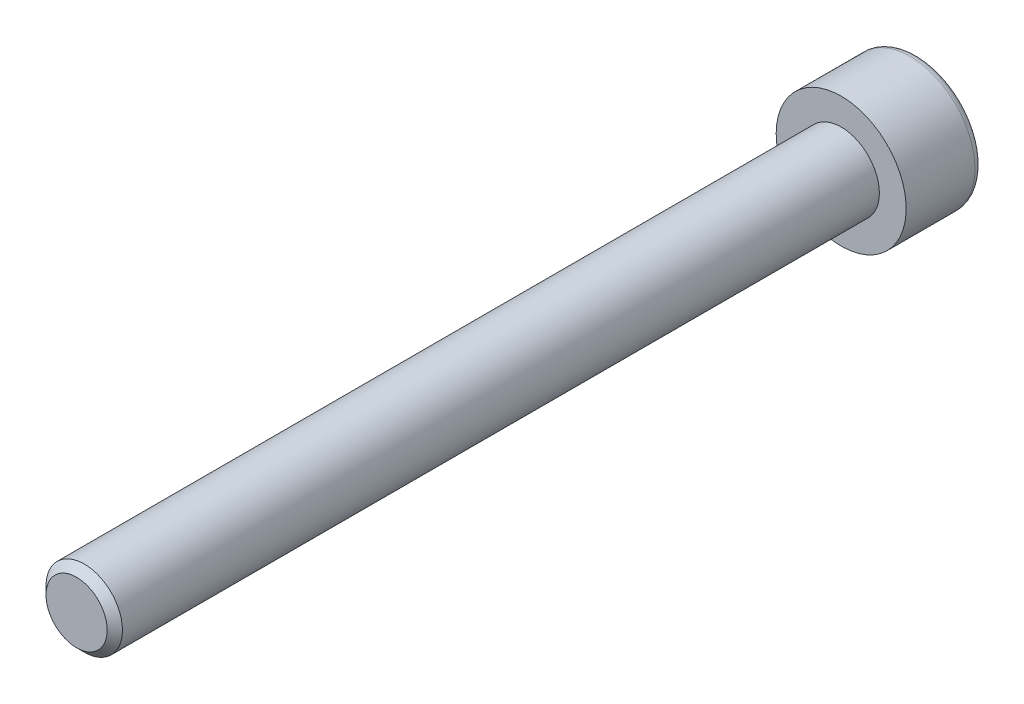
from build123d import *

# Parameters (mm, degrees)
ENLEV_MAT_EXTRU1_DEPTH = 2.5
ESQUISSE3_W            = 2.5
ESQUISSE3_H            = 50
CHANFREIN1_SIZE        = 0.5


with BuildPart() as part:
    # Esquisse1 → Base-R_volution (revolve)
    with BuildSketch(Plane(origin=(0, 0, 0), x_dir=(1, 0, 0), z_dir=(0, 1, 0)), mode=Mode.PRIVATE) as base_r_volution_sk:
        with BuildLine():
            Line((0, 0), (4.25, 0))
            Line((4.25, 0), (4.25, 4.5))
            ThreePointArc((4.25, 4.5), (4.103553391, 4.853553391), (3.75, 5))
            Line((3.75, 5), (0, 5))
            Line((0, 5), (0, 0))
        make_face()
    revolve(base_r_volution_sk.sketch.rotate(Axis((0, 0, 0), (0, 0, -1)), 180), axis=Axis((0, 0, 0), (0, 0, -1)))

    # Esquisse2 → enlev-mat-Extru1 (cut)
    with BuildSketch(Plane.XY.offset(-5)):
        Polygon((2, -1.154700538), (2, 1.154700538), (0, 2.309401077), (-2, 1.154700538), (-2, -1.154700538), (0, -2.309401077), align=None)
    extrude(amount=ENLEV_MAT_EXTRU1_DEPTH, mode=Mode.SUBTRACT)

    # Esquisse3 → Boss.-R_vol.1 (revolve)
    with BuildSketch(Plane(origin=(0, 0, 0), x_dir=(1, 0, 0), z_dir=(0, 1, 0))):
        with Locations((1.25, -25)):
            Rectangle(ESQUISSE3_W, ESQUISSE3_H)
    revolve(axis=Axis((0, 0, 0), (0, 0, 1)))

    # Chanfrein1
    chanfrein1_edges = [part.edges().sort_by_distance(p)[0] for p in [
        (-2.5, 0, 50),
    ]]
    chamfer(chanfrein1_edges, length=CHANFREIN1_SIZE)


solid = part.part
